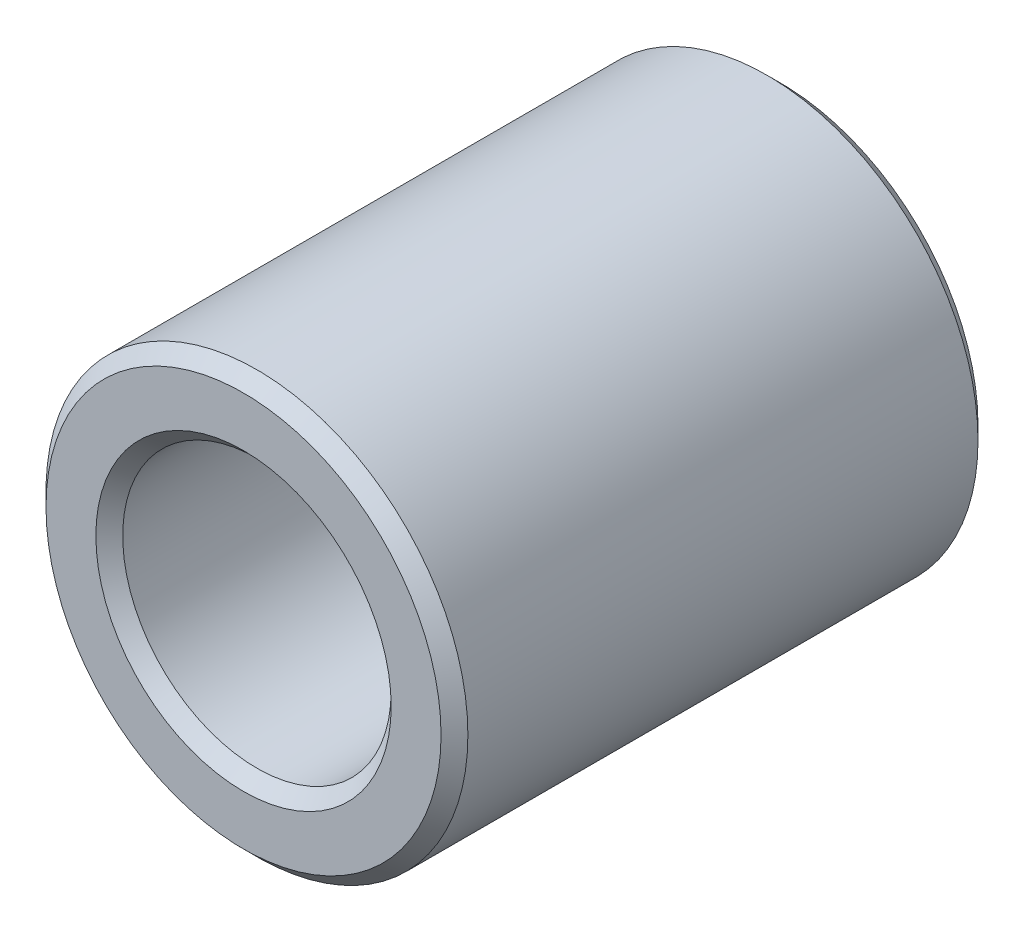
ISO-10303-21;
HEADER;
FILE_DESCRIPTION(('STEP AP214'),'2;1');
FILE_NAME('part.step','',(''),(''),'','','');
FILE_SCHEMA(('AUTOMOTIVE_DESIGN { 1 0 10303 214 1 1 1 1 }'));
ENDSEC;
DATA;
#1=APPLICATION_CONTEXT('core data for automotive mechanical design processes');
#2=APPLICATION_PROTOCOL_DEFINITION('international standard','automotive_design',2000,#1);
#3=PRODUCT_CONTEXT('',#1,'mechanical');
#4=PRODUCT('Part','Part','',(#3));
#5=PRODUCT_RELATED_PRODUCT_CATEGORY('part','',(#4));
#6=PRODUCT_DEFINITION_FORMATION('','',#4);
#7=PRODUCT_DEFINITION_CONTEXT('part definition',#1,'design');
#8=PRODUCT_DEFINITION('design','',#6,#7);
#9=PRODUCT_DEFINITION_SHAPE('','',#8);
#10=(LENGTH_UNIT() NAMED_UNIT(*) SI_UNIT(.MILLI.,.METRE.));
#11=(NAMED_UNIT(*) PLANE_ANGLE_UNIT() SI_UNIT($,.RADIAN.));
#12=(NAMED_UNIT(*) SI_UNIT($,.STERADIAN.) SOLID_ANGLE_UNIT());
#13=UNCERTAINTY_MEASURE_WITH_UNIT(LENGTH_MEASURE(1.E-05),#10,'distance_accuracy_value','');
#14=(GEOMETRIC_REPRESENTATION_CONTEXT(3) GLOBAL_UNCERTAINTY_ASSIGNED_CONTEXT((#13)) GLOBAL_UNIT_ASSIGNED_CONTEXT((#10,
#11,#12)) REPRESENTATION_CONTEXT('',''));
#15=CARTESIAN_POINT('',(0.,0.,0.));
#16=DIRECTION('',(0.,0.,1.));
#17=DIRECTION('',(1.,0.,0.));
#18=AXIS2_PLACEMENT_3D('',#15,#16,#17);
#19=CARTESIAN_POINT('',(0.,0.,70.));
#20=DIRECTION('',(0.,0.,1.));
#21=DIRECTION('',(1.,0.,0.));
#22=AXIS2_PLACEMENT_3D('',#19,#20,#21);
#23=PLANE('',#22);
#24=CARTESIAN_POINT('',(0.,0.,70.));
#25=DIRECTION('',(0.,0.,1.));
#26=DIRECTION('',(1.,0.,0.));
#27=AXIS2_PLACEMENT_3D('',#24,#25,#26);
#28=CIRCLE('',#27,38.5);
#29=CARTESIAN_POINT('',(38.5,0.,70.));
#30=VERTEX_POINT('',#29);
#31=EDGE_CURVE('E10',#30,#30,#28,.F.);
#32=ORIENTED_EDGE('',*,*,#31,.T.);
#33=EDGE_LOOP('',(#32));
#34=FACE_BOUND('',#33,.T.);
#35=CARTESIAN_POINT('',(0.,0.,70.));
#36=DIRECTION('',(0.,0.,1.));
#37=DIRECTION('',(1.,0.,0.));
#38=AXIS2_PLACEMENT_3D('',#35,#36,#37);
#39=CIRCLE('',#38,51.5);
#40=CARTESIAN_POINT('',(51.5,0.,70.));
#41=VERTEX_POINT('',#40);
#42=EDGE_CURVE('E45',#41,#41,#39,.T.);
#43=ORIENTED_EDGE('',*,*,#42,.T.);
#44=EDGE_LOOP('',(#43));
#45=FACE_BOUND('',#44,.T.);
#46=ADVANCED_FACE('F37',(#34,#45),#23,.T.);
#47=CARTESIAN_POINT('',(0.,0.,-70.));
#48=DIRECTION('',(0.,0.,1.));
#49=DIRECTION('',(1.,0.,0.));
#50=AXIS2_PLACEMENT_3D('',#47,#48,#49);
#51=PLANE('',#50);
#52=CARTESIAN_POINT('',(0.,0.,-70.));
#53=DIRECTION('',(0.,0.,1.));
#54=DIRECTION('',(1.,0.,0.));
#55=AXIS2_PLACEMENT_3D('',#52,#53,#54);
#56=CIRCLE('',#55,38.5);
#57=CARTESIAN_POINT('',(38.5,0.,-70.));
#58=VERTEX_POINT('',#57);
#59=EDGE_CURVE('E69',#58,#58,#56,.T.);
#60=ORIENTED_EDGE('',*,*,#59,.T.);
#61=EDGE_LOOP('',(#60));
#62=FACE_BOUND('',#61,.T.);
#63=CARTESIAN_POINT('',(0.,0.,-70.));
#64=DIRECTION('',(0.,0.,1.));
#65=DIRECTION('',(1.,0.,0.));
#66=AXIS2_PLACEMENT_3D('',#63,#64,#65);
#67=CIRCLE('',#66,51.5);
#68=CARTESIAN_POINT('',(51.5,0.,-70.));
#69=VERTEX_POINT('',#68);
#70=EDGE_CURVE('E73',#69,#69,#67,.F.);
#71=ORIENTED_EDGE('',*,*,#70,.T.);
#72=EDGE_LOOP('',(#71));
#73=FACE_BOUND('',#72,.T.);
#74=ADVANCED_FACE('F78',(#62,#73),#51,.F.);
#75=CARTESIAN_POINT('',(0.,0.,70.));
#76=DIRECTION('',(0.,0.,-1.));
#77=DIRECTION('',(-1.,0.,0.));
#78=AXIS2_PLACEMENT_3D('',#75,#76,#77);
#79=CYLINDRICAL_SURFACE('',#78,55.);
#80=CARTESIAN_POINT('',(0.,0.,-66.5));
#81=DIRECTION('',(0.,0.,1.));
#82=DIRECTION('',(1.,0.,0.));
#83=AXIS2_PLACEMENT_3D('',#80,#81,#82);
#84=CIRCLE('',#83,55.);
#85=CARTESIAN_POINT('',(55.,0.,-66.5));
#86=VERTEX_POINT('',#85);
#87=EDGE_CURVE('E52',#86,#86,#84,.T.);
#88=ORIENTED_EDGE('',*,*,#87,.T.);
#89=EDGE_LOOP('',(#88));
#90=FACE_BOUND('',#89,.T.);
#91=CARTESIAN_POINT('',(0.,0.,66.5));
#92=DIRECTION('',(0.,0.,1.));
#93=DIRECTION('',(1.,0.,0.));
#94=AXIS2_PLACEMENT_3D('',#91,#92,#93);
#95=CIRCLE('',#94,55.);
#96=CARTESIAN_POINT('',(55.,0.,66.5));
#97=VERTEX_POINT('',#96);
#98=EDGE_CURVE('E57',#97,#97,#95,.F.);
#99=ORIENTED_EDGE('',*,*,#98,.T.);
#100=EDGE_LOOP('',(#99));
#101=FACE_BOUND('',#100,.T.);
#102=ADVANCED_FACE('F88',(#90,#101),#79,.T.);
#103=CARTESIAN_POINT('',(0.,0.,70.));
#104=DIRECTION('',(0.,0.,-1.));
#105=DIRECTION('',(-1.,0.,0.));
#106=AXIS2_PLACEMENT_3D('',#103,#104,#105);
#107=CYLINDRICAL_SURFACE('',#106,35.);
#108=CARTESIAN_POINT('',(0.,0.,-66.5));
#109=DIRECTION('',(0.,0.,1.));
#110=DIRECTION('',(1.,0.,0.));
#111=AXIS2_PLACEMENT_3D('',#108,#109,#110);
#112=CIRCLE('',#111,35.);
#113=CARTESIAN_POINT('',(35.,0.,-66.5));
#114=VERTEX_POINT('',#113);
#115=EDGE_CURVE('E63',#114,#114,#112,.F.);
#116=ORIENTED_EDGE('',*,*,#115,.T.);
#117=EDGE_LOOP('',(#116));
#118=FACE_BOUND('',#117,.T.);
#119=CARTESIAN_POINT('',(0.,0.,66.5));
#120=DIRECTION('',(0.,0.,1.));
#121=DIRECTION('',(1.,0.,0.));
#122=AXIS2_PLACEMENT_3D('',#119,#120,#121);
#123=CIRCLE('',#122,35.);
#124=CARTESIAN_POINT('',(35.,0.,66.5));
#125=VERTEX_POINT('',#124);
#126=EDGE_CURVE('E66',#125,#125,#123,.T.);
#127=ORIENTED_EDGE('',*,*,#126,.T.);
#128=EDGE_LOOP('',(#127));
#129=FACE_BOUND('',#128,.T.);
#130=ADVANCED_FACE('F91',(#118,#129),#107,.F.);
#131=CARTESIAN_POINT('',(0.,0.,-70.));
#132=DIRECTION('',(0.,0.,-1.));
#133=DIRECTION('',(-1.,0.,0.));
#134=AXIS2_PLACEMENT_3D('',#131,#132,#133);
#135=CONICAL_SURFACE('',#134,38.5,0.785398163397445);
#136=ORIENTED_EDGE('',*,*,#115,.F.);
#137=EDGE_LOOP('',(#136));
#138=FACE_BOUND('',#137,.T.);
#139=ORIENTED_EDGE('',*,*,#59,.F.);
#140=EDGE_LOOP('',(#139));
#141=FACE_BOUND('',#140,.T.);
#142=ADVANCED_FACE('F84',(#138,#141),#135,.F.);
#143=CARTESIAN_POINT('',(0.,0.,-66.5));
#144=DIRECTION('',(0.,0.,1.));
#145=DIRECTION('',(1.,0.,0.));
#146=AXIS2_PLACEMENT_3D('',#143,#144,#145);
#147=CONICAL_SURFACE('',#146,55.,0.785398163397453);
#148=CARTESIAN_POINT('',(51.5,0.,-70.));
#149=CARTESIAN_POINT('',(51.5364583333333,0.,-69.9635416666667));
#150=CARTESIAN_POINT('',(51.5729166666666,0.,-69.9270833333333));
#151=CARTESIAN_POINT('',(51.6458333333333,0.,-69.8541666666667));
#152=CARTESIAN_POINT('',(51.6822916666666,0.,-69.8177083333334));
#153=CARTESIAN_POINT('',(51.7552083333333,0.,-69.7447916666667));
#154=CARTESIAN_POINT('',(51.7916666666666,0.,-69.7083333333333));
#155=CARTESIAN_POINT('',(51.8645833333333,0.,-69.6354166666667));
#156=CARTESIAN_POINT('',(51.9010416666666,0.,-69.5989583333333));
#157=CARTESIAN_POINT('',(51.9739583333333,0.,-69.5260416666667));
#158=CARTESIAN_POINT('',(52.0104166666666,0.,-69.4895833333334));
#159=CARTESIAN_POINT('',(52.0833333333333,0.,-69.4166666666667));
#160=CARTESIAN_POINT('',(52.1197916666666,0.,-69.3802083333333));
#161=CARTESIAN_POINT('',(52.1927083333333,0.,-69.3072916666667));
#162=CARTESIAN_POINT('',(52.2291666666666,0.,-69.2708333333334));
#163=CARTESIAN_POINT('',(52.3020833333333,0.,-69.1979166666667));
#164=CARTESIAN_POINT('',(52.3385416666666,0.,-69.1614583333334));
#165=CARTESIAN_POINT('',(52.4114583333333,0.,-69.0885416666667));
#166=CARTESIAN_POINT('',(52.4479166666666,0.,-69.0520833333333));
#167=CARTESIAN_POINT('',(52.5208333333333,0.,-68.9791666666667));
#168=CARTESIAN_POINT('',(52.5572916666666,0.,-68.9427083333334));
#169=CARTESIAN_POINT('',(52.6302083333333,0.,-68.8697916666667));
#170=CARTESIAN_POINT('',(52.6666666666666,0.,-68.8333333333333));
#171=CARTESIAN_POINT('',(52.7395833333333,0.,-68.7604166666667));
#172=CARTESIAN_POINT('',(52.7760416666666,0.,-68.7239583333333));
#173=CARTESIAN_POINT('',(52.8489583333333,0.,-68.6510416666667));
#174=CARTESIAN_POINT('',(52.8854166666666,0.,-68.6145833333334));
#175=CARTESIAN_POINT('',(52.9583333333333,0.,-68.5416666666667));
#176=CARTESIAN_POINT('',(52.9947916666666,0.,-68.5052083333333));
#177=CARTESIAN_POINT('',(53.0677083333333,0.,-68.4322916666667));
#178=CARTESIAN_POINT('',(53.1041666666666,0.,-68.3958333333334));
#179=CARTESIAN_POINT('',(53.1770833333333,0.,-68.3229166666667));
#180=CARTESIAN_POINT('',(53.2135416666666,0.,-68.2864583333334));
#181=CARTESIAN_POINT('',(53.2864583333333,0.,-68.2135416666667));
#182=CARTESIAN_POINT('',(53.3229166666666,0.,-68.1770833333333));
#183=CARTESIAN_POINT('',(53.3958333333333,0.,-68.1041666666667));
#184=CARTESIAN_POINT('',(53.4322916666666,0.,-68.0677083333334));
#185=CARTESIAN_POINT('',(53.5052083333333,0.,-67.9947916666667));
#186=CARTESIAN_POINT('',(53.5416666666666,0.,-67.9583333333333));
#187=CARTESIAN_POINT('',(53.6145833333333,0.,-67.8854166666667));
#188=CARTESIAN_POINT('',(53.6510416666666,0.,-67.8489583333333));
#189=CARTESIAN_POINT('',(53.7239583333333,0.,-67.7760416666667));
#190=CARTESIAN_POINT('',(53.7604166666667,0.,-67.7395833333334));
#191=CARTESIAN_POINT('',(53.8333333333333,0.,-67.6666666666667));
#192=CARTESIAN_POINT('',(53.8697916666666,0.,-67.6302083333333));
#193=CARTESIAN_POINT('',(53.9427083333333,0.,-67.5572916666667));
#194=CARTESIAN_POINT('',(53.9791666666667,0.,-67.5208333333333));
#195=CARTESIAN_POINT('',(54.0520833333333,0.,-67.4479166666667));
#196=CARTESIAN_POINT('',(54.0885416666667,0.,-67.4114583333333));
#197=CARTESIAN_POINT('',(54.1614583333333,0.,-67.3385416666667));
#198=CARTESIAN_POINT('',(54.1979166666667,0.,-67.3020833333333));
#199=CARTESIAN_POINT('',(54.2708333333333,0.,-67.2291666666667));
#200=CARTESIAN_POINT('',(54.3072916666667,0.,-67.1927083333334));
#201=CARTESIAN_POINT('',(54.3802083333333,0.,-67.1197916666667));
#202=CARTESIAN_POINT('',(54.4166666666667,0.,-67.0833333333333));
#203=CARTESIAN_POINT('',(54.4895833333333,0.,-67.0104166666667));
#204=CARTESIAN_POINT('',(54.5260416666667,0.,-66.9739583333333));
#205=CARTESIAN_POINT('',(54.5989583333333,0.,-66.9010416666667));
#206=CARTESIAN_POINT('',(54.6354166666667,0.,-66.8645833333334));
#207=CARTESIAN_POINT('',(54.7083333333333,0.,-66.7916666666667));
#208=CARTESIAN_POINT('',(54.7447916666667,0.,-66.7552083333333));
#209=CARTESIAN_POINT('',(54.8177083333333,0.,-66.6822916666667));
#210=CARTESIAN_POINT('',(54.8541666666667,0.,-66.6458333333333));
#211=CARTESIAN_POINT('',(54.9270833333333,0.,-66.5729166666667));
#212=CARTESIAN_POINT('',(54.9635416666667,0.,-66.5364583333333));
#213=CARTESIAN_POINT('',(55.,0.,-66.5));
#214=B_SPLINE_CURVE_WITH_KNOTS('',3,(#148,#149,#150,#151,#152,#153,#154,#155,#156,#157,#158,
#159,#160,#161,#162,#163,#164,#165,#166,#167,#168,#169,#170,#171,#172,#173,#174,#175,#176,#177,
#178,#179,#180,#181,#182,#183,#184,#185,#186,#187,#188,#189,#190,#191,#192,#193,#194,#195,#196,
#197,#198,#199,#200,#201,#202,#203,#204,#205,#206,#207,#208,#209,#210,#211,#212,#213),
.UNSPECIFIED.,.F.,.F.,(4,2,2,2,2,2,2,2,2,2,2,2,2,2,2,2,2,2,2,2,2,2,2,2,2,2,2,2,2,2,2,2,4),(0.,
0.154679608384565,0.30935921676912,0.464038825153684,0.618718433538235,0.773398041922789,
0.928077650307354,1.08275725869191,1.23743686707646,1.39211647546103,1.54679608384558,
1.70147569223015,1.8561553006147,2.01083490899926,2.16551451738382,2.32019412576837,
2.47487373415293,2.62955334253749,2.78423295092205,2.93891255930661,3.09359216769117,
3.24827177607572,3.40295138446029,3.55763099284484,3.71231060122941,3.86699020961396,
4.02166981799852,4.17634942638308,4.33102903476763,4.48570864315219,4.64038825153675,
4.79506785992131,4.94974746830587),.UNSPECIFIED.);
#215=EDGE_CURVE('BSEAM80',#69,#86,#214,.T.);
#216=ORIENTED_EDGE('',*,*,#70,.F.);
#217=ORIENTED_EDGE('',*,*,#87,.F.);
#218=ORIENTED_EDGE('',*,*,#215,.T.);
#219=ORIENTED_EDGE('',*,*,#215,.F.);
#220=EDGE_LOOP('',(#216,#218,#217,#219));
#221=FACE_BOUND('',#220,.T.);
#222=ADVANCED_FACE('F80',(#221),#147,.T.);
#223=CARTESIAN_POINT('',(0.,0.,66.5));
#224=DIRECTION('',(0.,0.,1.));
#225=DIRECTION('',(1.,0.,0.));
#226=AXIS2_PLACEMENT_3D('',#223,#224,#225);
#227=CONICAL_SURFACE('',#226,35.,0.785398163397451);
#228=CARTESIAN_POINT('',(38.5,0.,70.));
#229=CARTESIAN_POINT('',(38.4635416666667,0.,69.9635416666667));
#230=CARTESIAN_POINT('',(38.4270833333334,0.,69.9270833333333));
#231=CARTESIAN_POINT('',(38.3541666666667,0.,69.8541666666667));
#232=CARTESIAN_POINT('',(38.3177083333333,0.,69.8177083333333));
#233=CARTESIAN_POINT('',(38.2447916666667,0.,69.7447916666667));
#234=CARTESIAN_POINT('',(38.2083333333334,0.,69.7083333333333));
#235=CARTESIAN_POINT('',(38.1354166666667,0.,69.6354166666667));
#236=CARTESIAN_POINT('',(38.0989583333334,0.,69.5989583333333));
#237=CARTESIAN_POINT('',(38.0260416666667,0.,69.5260416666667));
#238=CARTESIAN_POINT('',(37.9895833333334,0.,69.4895833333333));
#239=CARTESIAN_POINT('',(37.9166666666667,0.,69.4166666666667));
#240=CARTESIAN_POINT('',(37.8802083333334,0.,69.3802083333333));
#241=CARTESIAN_POINT('',(37.8072916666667,0.,69.3072916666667));
#242=CARTESIAN_POINT('',(37.7708333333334,0.,69.2708333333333));
#243=CARTESIAN_POINT('',(37.6979166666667,0.,69.1979166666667));
#244=CARTESIAN_POINT('',(37.6614583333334,0.,69.1614583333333));
#245=CARTESIAN_POINT('',(37.5885416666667,0.,69.0885416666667));
#246=CARTESIAN_POINT('',(37.5520833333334,0.,69.0520833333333));
#247=CARTESIAN_POINT('',(37.4791666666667,0.,68.9791666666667));
#248=CARTESIAN_POINT('',(37.4427083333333,0.,68.9427083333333));
#249=CARTESIAN_POINT('',(37.3697916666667,0.,68.8697916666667));
#250=CARTESIAN_POINT('',(37.3333333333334,0.,68.8333333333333));
#251=CARTESIAN_POINT('',(37.2604166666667,0.,68.7604166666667));
#252=CARTESIAN_POINT('',(37.2239583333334,0.,68.7239583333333));
#253=CARTESIAN_POINT('',(37.1510416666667,0.,68.6510416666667));
#254=CARTESIAN_POINT('',(37.1145833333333,0.,68.6145833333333));
#255=CARTESIAN_POINT('',(37.0416666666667,0.,68.5416666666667));
#256=CARTESIAN_POINT('',(37.0052083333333,0.,68.5052083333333));
#257=CARTESIAN_POINT('',(36.9322916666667,0.,68.4322916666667));
#258=CARTESIAN_POINT('',(36.8958333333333,0.,68.3958333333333));
#259=CARTESIAN_POINT('',(36.8229166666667,0.,68.3229166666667));
#260=CARTESIAN_POINT('',(36.7864583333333,0.,68.2864583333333));
#261=CARTESIAN_POINT('',(36.7135416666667,0.,68.2135416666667));
#262=CARTESIAN_POINT('',(36.6770833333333,0.,68.1770833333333));
#263=CARTESIAN_POINT('',(36.6041666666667,0.,68.1041666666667));
#264=CARTESIAN_POINT('',(36.5677083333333,0.,68.0677083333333));
#265=CARTESIAN_POINT('',(36.4947916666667,0.,67.9947916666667));
#266=CARTESIAN_POINT('',(36.4583333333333,0.,67.9583333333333));
#267=CARTESIAN_POINT('',(36.3854166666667,0.,67.8854166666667));
#268=CARTESIAN_POINT('',(36.3489583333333,0.,67.8489583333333));
#269=CARTESIAN_POINT('',(36.2760416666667,0.,67.7760416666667));
#270=CARTESIAN_POINT('',(36.2395833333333,0.,67.7395833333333));
#271=CARTESIAN_POINT('',(36.1666666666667,0.,67.6666666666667));
#272=CARTESIAN_POINT('',(36.1302083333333,0.,67.6302083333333));
#273=CARTESIAN_POINT('',(36.0572916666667,0.,67.5572916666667));
#274=CARTESIAN_POINT('',(36.0208333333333,0.,67.5208333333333));
#275=CARTESIAN_POINT('',(35.9479166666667,0.,67.4479166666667));
#276=CARTESIAN_POINT('',(35.9114583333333,0.,67.4114583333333));
#277=CARTESIAN_POINT('',(35.8385416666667,0.,67.3385416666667));
#278=CARTESIAN_POINT('',(35.8020833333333,0.,67.3020833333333));
#279=CARTESIAN_POINT('',(35.7291666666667,0.,67.2291666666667));
#280=CARTESIAN_POINT('',(35.6927083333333,0.,67.1927083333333));
#281=CARTESIAN_POINT('',(35.6197916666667,0.,67.1197916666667));
#282=CARTESIAN_POINT('',(35.5833333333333,0.,67.0833333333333));
#283=CARTESIAN_POINT('',(35.5104166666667,0.,67.0104166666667));
#284=CARTESIAN_POINT('',(35.4739583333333,0.,66.9739583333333));
#285=CARTESIAN_POINT('',(35.4010416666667,0.,66.9010416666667));
#286=CARTESIAN_POINT('',(35.3645833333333,0.,66.8645833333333));
#287=CARTESIAN_POINT('',(35.2916666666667,0.,66.7916666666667));
#288=CARTESIAN_POINT('',(35.2552083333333,0.,66.7552083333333));
#289=CARTESIAN_POINT('',(35.1822916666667,0.,66.6822916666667));
#290=CARTESIAN_POINT('',(35.1458333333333,0.,66.6458333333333));
#291=CARTESIAN_POINT('',(35.0729166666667,0.,66.5729166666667));
#292=CARTESIAN_POINT('',(35.0364583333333,0.,66.5364583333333));
#293=CARTESIAN_POINT('',(35.,0.,66.5));
#294=B_SPLINE_CURVE_WITH_KNOTS('',3,(#228,#229,#230,#231,#232,#233,#234,#235,#236,#237,#238,
#239,#240,#241,#242,#243,#244,#245,#246,#247,#248,#249,#250,#251,#252,#253,#254,#255,#256,#257,
#258,#259,#260,#261,#262,#263,#264,#265,#266,#267,#268,#269,#270,#271,#272,#273,#274,#275,#276,
#277,#278,#279,#280,#281,#282,#283,#284,#285,#286,#287,#288,#289,#290,#291,#292,#293),
.UNSPECIFIED.,.F.,.F.,(4,2,2,2,2,2,2,2,2,2,2,2,2,2,2,2,2,2,2,2,2,2,2,2,2,2,2,2,2,2,2,2,4),(0.,
0.154679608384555,0.30935921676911,0.464038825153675,0.618718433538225,0.77339804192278,
0.928077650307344,1.0827572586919,1.23743686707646,1.39211647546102,1.54679608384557,
1.70147569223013,1.85615530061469,2.01083490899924,2.16551451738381,2.32019412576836,
2.47487373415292,2.62955334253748,2.78423295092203,2.9389125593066,3.09359216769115,
3.24827177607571,3.40295138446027,3.55763099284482,3.71231060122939,3.86699020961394,
4.0216698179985,4.17634942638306,4.33102903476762,4.48570864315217,4.64038825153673,
4.79506785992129,4.94974746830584),.UNSPECIFIED.);
#295=EDGE_CURVE('BSEAM83',#30,#125,#294,.T.);
#296=ORIENTED_EDGE('',*,*,#31,.F.);
#297=ORIENTED_EDGE('',*,*,#126,.F.);
#298=ORIENTED_EDGE('',*,*,#295,.T.);
#299=ORIENTED_EDGE('',*,*,#295,.F.);
#300=EDGE_LOOP('',(#296,#298,#297,#299));
#301=FACE_BOUND('',#300,.T.);
#302=ADVANCED_FACE('F83',(#301),#227,.F.);
#303=CARTESIAN_POINT('',(0.,0.,70.));
#304=DIRECTION('',(0.,0.,-1.));
#305=DIRECTION('',(-1.,0.,0.));
#306=AXIS2_PLACEMENT_3D('',#303,#304,#305);
#307=CONICAL_SURFACE('',#306,51.5,0.785398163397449);
#308=ORIENTED_EDGE('',*,*,#98,.F.);
#309=EDGE_LOOP('',(#308));
#310=FACE_BOUND('',#309,.T.);
#311=ORIENTED_EDGE('',*,*,#42,.F.);
#312=EDGE_LOOP('',(#311));
#313=FACE_BOUND('',#312,.T.);
#314=ADVANCED_FACE('F39',(#310,#313),#307,.T.);
#315=CLOSED_SHELL('',(#46,#74,#102,#130,#142,#222,#302,#314));
#316=MANIFOLD_SOLID_BREP('B2',#315);
#317=ADVANCED_BREP_SHAPE_REPRESENTATION('',(#18,#316),#14);
#318=SHAPE_DEFINITION_REPRESENTATION(#9,#317);
ENDSEC;
END-ISO-10303-21;
